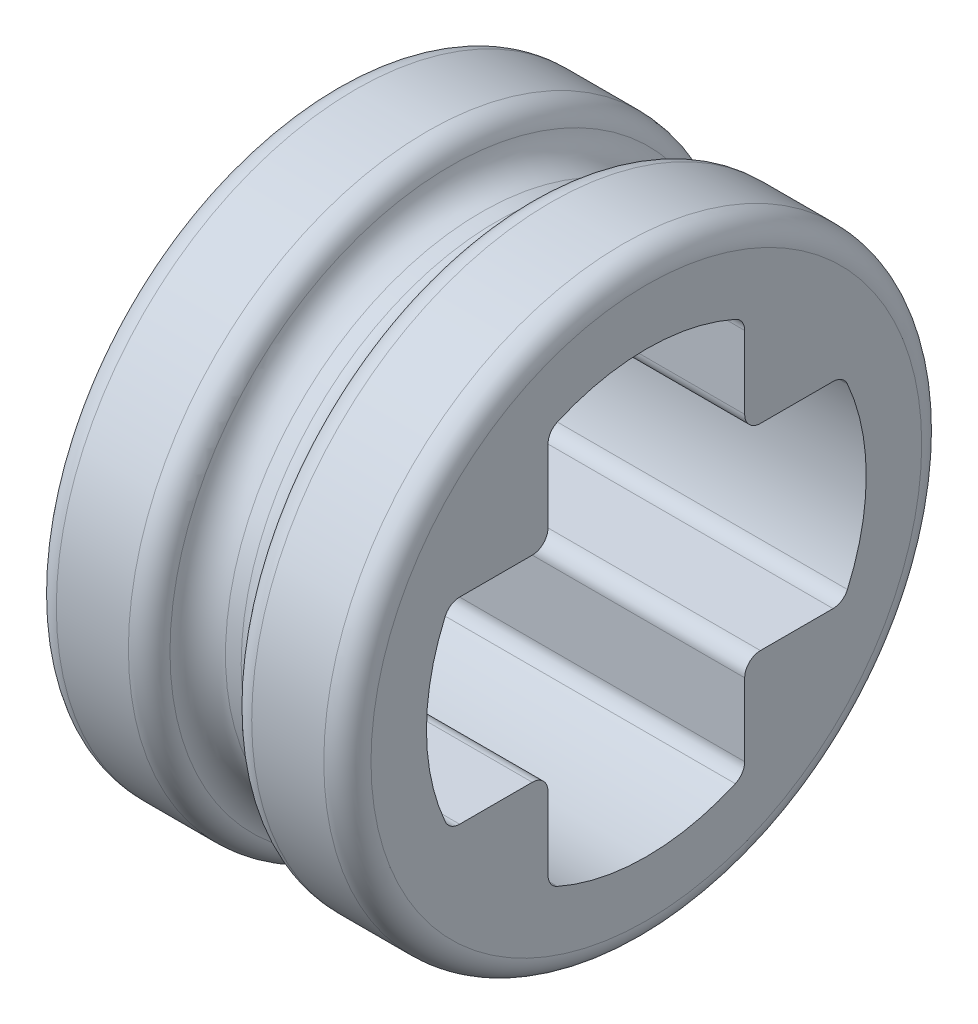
ISO-10303-21;
HEADER;
FILE_DESCRIPTION(('STEP AP214'),'2;1');
FILE_NAME('part.step','',(''),(''),'','','');
FILE_SCHEMA(('AUTOMOTIVE_DESIGN { 1 0 10303 214 1 1 1 1 }'));
ENDSEC;
DATA;
#1=APPLICATION_CONTEXT('core data for automotive mechanical design processes');
#2=APPLICATION_PROTOCOL_DEFINITION('international standard','automotive_design',2000,#1);
#3=PRODUCT_CONTEXT('',#1,'mechanical');
#4=PRODUCT('Part','Part','',(#3));
#5=PRODUCT_RELATED_PRODUCT_CATEGORY('part','',(#4));
#6=PRODUCT_DEFINITION_FORMATION('','',#4);
#7=PRODUCT_DEFINITION_CONTEXT('part definition',#1,'design');
#8=PRODUCT_DEFINITION('design','',#6,#7);
#9=PRODUCT_DEFINITION_SHAPE('','',#8);
#10=(LENGTH_UNIT() NAMED_UNIT(*) SI_UNIT(.MILLI.,.METRE.));
#11=(NAMED_UNIT(*) PLANE_ANGLE_UNIT() SI_UNIT($,.RADIAN.));
#12=(NAMED_UNIT(*) SI_UNIT($,.STERADIAN.) SOLID_ANGLE_UNIT());
#13=UNCERTAINTY_MEASURE_WITH_UNIT(LENGTH_MEASURE(1.E-05),#10,'distance_accuracy_value','');
#14=(GEOMETRIC_REPRESENTATION_CONTEXT(3) GLOBAL_UNCERTAINTY_ASSIGNED_CONTEXT((#13)) GLOBAL_UNIT_ASSIGNED_CONTEXT((#10,
#11,#12)) REPRESENTATION_CONTEXT('',''));
#15=CARTESIAN_POINT('',(0.,0.,0.));
#16=DIRECTION('',(0.,0.,1.));
#17=DIRECTION('',(1.,0.,0.));
#18=AXIS2_PLACEMENT_3D('',#15,#16,#17);
#19=CARTESIAN_POINT('',(2.,0.,0.));
#20=DIRECTION('',(-1.,0.,0.));
#21=DIRECTION('',(0.,0.,1.));
#22=AXIS2_PLACEMENT_3D('',#19,#20,#21);
#23=CYLINDRICAL_SURFACE('',#22,2.79508497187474);
#24=CARTESIAN_POINT('',(-1.95,0.,0.));
#25=DIRECTION('',(-1.,0.,0.));
#26=DIRECTION('',(0.,0.,1.));
#27=AXIS2_PLACEMENT_3D('',#24,#25,#26);
#28=CIRCLE('',#27,2.79508497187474);
#29=CARTESIAN_POINT('',(-1.95,2.55607413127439,-1.13092220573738));
#30=VERTEX_POINT('',#29);
#31=CARTESIAN_POINT('',(-1.95,2.55607413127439,1.13092220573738));
#32=VERTEX_POINT('',#31);
#33=EDGE_CURVE('E549',#30,#32,#28,.F.);
#34=ORIENTED_EDGE('',*,*,#33,.F.);
#35=DIRECTION('',(-1.,0.,0.));
#36=VECTOR('',#35,1.);
#37=CARTESIAN_POINT('',(2.,2.55607413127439,-1.13092220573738));
#38=LINE('',#37,#36);
#39=CARTESIAN_POINT('',(2.,2.55607413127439,-1.13092220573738));
#40=VERTEX_POINT('',#39);
#41=EDGE_CURVE('E411',#30,#40,#38,.F.);
#42=ORIENTED_EDGE('',*,*,#41,.T.);
#43=CARTESIAN_POINT('',(2.,0.,0.));
#44=DIRECTION('',(-1.,0.,0.));
#45=DIRECTION('',(0.,0.,1.));
#46=AXIS2_PLACEMENT_3D('',#43,#44,#45);
#47=CIRCLE('',#46,2.79508497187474);
#48=CARTESIAN_POINT('',(2.,2.55607413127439,1.13092220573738));
#49=VERTEX_POINT('',#48);
#50=EDGE_CURVE('E453',#49,#40,#47,.T.);
#51=ORIENTED_EDGE('',*,*,#50,.F.);
#52=DIRECTION('',(-1.,0.,0.));
#53=VECTOR('',#52,1.);
#54=CARTESIAN_POINT('',(2.,2.55607413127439,1.13092220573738));
#55=LINE('',#54,#53);
#56=EDGE_CURVE('E414',#49,#32,#55,.T.);
#57=ORIENTED_EDGE('',*,*,#56,.T.);
#58=EDGE_LOOP('',(#34,#42,#51,#57));
#59=FACE_BOUND('',#58,.T.);
#60=ADVANCED_FACE('F57',(#59),#23,.F.);
#61=CARTESIAN_POINT('',(2.,2.5,1.25000000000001));
#62=DIRECTION('',(0.,0.,1.));
#63=DIRECTION('',(0.,-1.,0.));
#64=AXIS2_PLACEMENT_3D('',#61,#62,#63);
#65=PLANE('',#64);
#66=DIRECTION('',(0.,-1.,0.));
#67=VECTOR('',#66,1.);
#68=CARTESIAN_POINT('',(-1.95,2.5,1.25000000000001));
#69=LINE('',#68,#67);
#70=CARTESIAN_POINT('',(-1.95,2.37317635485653,1.25000000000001));
#71=VERTEX_POINT('',#70);
#72=CARTESIAN_POINT('',(-1.95,1.45,1.25000000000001));
#73=VERTEX_POINT('',#72);
#74=EDGE_CURVE('E537',#71,#73,#69,.T.);
#75=ORIENTED_EDGE('',*,*,#74,.F.);
#76=DIRECTION('',(1.,0.,0.));
#77=VECTOR('',#76,1.);
#78=CARTESIAN_POINT('',(2.,2.37317635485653,1.25000000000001));
#79=LINE('',#78,#77);
#80=CARTESIAN_POINT('',(2.,2.37317635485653,1.25000000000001));
#81=VERTEX_POINT('',#80);
#82=EDGE_CURVE('E80',#71,#81,#79,.T.);
#83=ORIENTED_EDGE('',*,*,#82,.T.);
#84=DIRECTION('',(0.,1.,0.));
#85=VECTOR('',#84,1.);
#86=CARTESIAN_POINT('',(2.,2.5,1.25000000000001));
#87=LINE('',#86,#85);
#88=CARTESIAN_POINT('',(2.,1.45,1.25000000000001));
#89=VERTEX_POINT('',#88);
#90=EDGE_CURVE('E478',#89,#81,#87,.T.);
#91=ORIENTED_EDGE('',*,*,#90,.F.);
#92=DIRECTION('',(-1.,0.,0.));
#93=VECTOR('',#92,1.);
#94=CARTESIAN_POINT('',(2.,1.45,1.25000000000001));
#95=LINE('',#94,#93);
#96=EDGE_CURVE('E407',#89,#73,#95,.T.);
#97=ORIENTED_EDGE('',*,*,#96,.T.);
#98=EDGE_LOOP('',(#75,#83,#91,#97));
#99=FACE_BOUND('',#98,.T.);
#100=ADVANCED_FACE('F329',(#99),#65,.F.);
#101=CARTESIAN_POINT('',(2.,1.25,1.25000000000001));
#102=DIRECTION('',(0.,1.,0.));
#103=DIRECTION('',(0.,0.,1.));
#104=AXIS2_PLACEMENT_3D('',#101,#102,#103);
#105=PLANE('',#104);
#106=DIRECTION('',(0.,0.,1.));
#107=VECTOR('',#106,1.);
#108=CARTESIAN_POINT('',(-1.95,1.25,1.25000000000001));
#109=LINE('',#108,#107);
#110=CARTESIAN_POINT('',(-1.95,1.25,1.45000000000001));
#111=VERTEX_POINT('',#110);
#112=CARTESIAN_POINT('',(-1.95,1.25,2.37317635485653));
#113=VERTEX_POINT('',#112);
#114=EDGE_CURVE('E524',#111,#113,#109,.T.);
#115=ORIENTED_EDGE('',*,*,#114,.F.);
#116=DIRECTION('',(-1.,0.,0.));
#117=VECTOR('',#116,1.);
#118=CARTESIAN_POINT('',(2.,1.25,1.45000000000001));
#119=LINE('',#118,#117);
#120=CARTESIAN_POINT('',(2.,1.25,1.45000000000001));
#121=VERTEX_POINT('',#120);
#122=EDGE_CURVE('E398',#111,#121,#119,.F.);
#123=ORIENTED_EDGE('',*,*,#122,.T.);
#124=DIRECTION('',(0.,0.,-1.));
#125=VECTOR('',#124,1.);
#126=CARTESIAN_POINT('',(2.,1.25,1.25000000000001));
#127=LINE('',#126,#125);
#128=CARTESIAN_POINT('',(2.,1.25,2.37317635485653));
#129=VERTEX_POINT('',#128);
#130=EDGE_CURVE('E481',#129,#121,#127,.T.);
#131=ORIENTED_EDGE('',*,*,#130,.F.);
#132=DIRECTION('',(1.,0.,0.));
#133=VECTOR('',#132,1.);
#134=CARTESIAN_POINT('',(-2.,1.25,2.37317635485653));
#135=LINE('',#134,#133);
#136=EDGE_CURVE('E401',#129,#113,#135,.F.);
#137=ORIENTED_EDGE('',*,*,#136,.T.);
#138=EDGE_LOOP('',(#115,#123,#131,#137));
#139=FACE_BOUND('',#138,.T.);
#140=ADVANCED_FACE('F335',(#139),#105,.F.);
#141=CARTESIAN_POINT('',(2.,0.,0.));
#142=DIRECTION('',(-1.,0.,0.));
#143=DIRECTION('',(0.,0.,1.));
#144=AXIS2_PLACEMENT_3D('',#141,#142,#143);
#145=CYLINDRICAL_SURFACE('',#144,2.79508497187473);
#146=CARTESIAN_POINT('',(-1.95,0.,0.));
#147=DIRECTION('',(-1.,0.,0.));
#148=DIRECTION('',(0.,0.,1.));
#149=AXIS2_PLACEMENT_3D('',#146,#147,#148);
#150=CIRCLE('',#149,2.79508497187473);
#151=CARTESIAN_POINT('',(-1.95,1.13092220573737,2.55607413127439));
#152=VERTEX_POINT('',#151);
#153=CARTESIAN_POINT('',(-1.95,-1.13092220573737,2.55607413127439));
#154=VERTEX_POINT('',#153);
#155=EDGE_CURVE('E512',#152,#154,#150,.F.);
#156=ORIENTED_EDGE('',*,*,#155,.F.);
#157=DIRECTION('',(-1.,0.,0.));
#158=VECTOR('',#157,1.);
#159=CARTESIAN_POINT('',(2.,1.13092220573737,2.55607413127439));
#160=LINE('',#159,#158);
#161=CARTESIAN_POINT('',(2.,1.13092220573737,2.55607413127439));
#162=VERTEX_POINT('',#161);
#163=EDGE_CURVE('E391',#152,#162,#160,.F.);
#164=ORIENTED_EDGE('',*,*,#163,.T.);
#165=CARTESIAN_POINT('',(2.,0.,0.));
#166=DIRECTION('',(-1.,0.,0.));
#167=DIRECTION('',(0.,0.,1.));
#168=AXIS2_PLACEMENT_3D('',#165,#166,#167);
#169=CIRCLE('',#168,2.79508497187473);
#170=CARTESIAN_POINT('',(2.,-1.13092220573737,2.55607413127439));
#171=VERTEX_POINT('',#170);
#172=EDGE_CURVE('E485',#171,#162,#169,.T.);
#173=ORIENTED_EDGE('',*,*,#172,.F.);
#174=DIRECTION('',(-1.,0.,0.));
#175=VECTOR('',#174,1.);
#176=CARTESIAN_POINT('',(2.,-1.13092220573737,2.55607413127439));
#177=LINE('',#176,#175);
#178=EDGE_CURVE('E394',#171,#154,#177,.T.);
#179=ORIENTED_EDGE('',*,*,#178,.T.);
#180=EDGE_LOOP('',(#156,#164,#173,#179));
#181=FACE_BOUND('',#180,.T.);
#182=ADVANCED_FACE('F596',(#181),#145,.F.);
#183=CARTESIAN_POINT('',(2.,-1.25,1.25000000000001));
#184=DIRECTION('',(0.,-1.,0.));
#185=DIRECTION('',(0.,0.,-1.));
#186=AXIS2_PLACEMENT_3D('',#183,#184,#185);
#187=PLANE('',#186);
#188=DIRECTION('',(0.,0.,-1.));
#189=VECTOR('',#188,1.);
#190=CARTESIAN_POINT('',(-1.95,-1.25,1.25000000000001));
#191=LINE('',#190,#189);
#192=CARTESIAN_POINT('',(-1.95,-1.25,2.37317635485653));
#193=VERTEX_POINT('',#192);
#194=CARTESIAN_POINT('',(-1.95,-1.25,1.45000000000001));
#195=VERTEX_POINT('',#194);
#196=EDGE_CURVE('E515',#193,#195,#191,.T.);
#197=ORIENTED_EDGE('',*,*,#196,.F.);
#198=DIRECTION('',(1.,0.,0.));
#199=VECTOR('',#198,1.);
#200=CARTESIAN_POINT('',(2.,-1.25,2.37317635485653));
#201=LINE('',#200,#199);
#202=CARTESIAN_POINT('',(2.,-1.25,2.37317635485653));
#203=VERTEX_POINT('',#202);
#204=EDGE_CURVE('E467',#193,#203,#201,.T.);
#205=ORIENTED_EDGE('',*,*,#204,.T.);
#206=DIRECTION('',(0.,0.,1.));
#207=VECTOR('',#206,1.);
#208=CARTESIAN_POINT('',(2.,-1.25,1.25000000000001));
#209=LINE('',#208,#207);
#210=CARTESIAN_POINT('',(2.,-1.25,1.45000000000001));
#211=VERTEX_POINT('',#210);
#212=EDGE_CURVE('E365',#211,#203,#209,.T.);
#213=ORIENTED_EDGE('',*,*,#212,.F.);
#214=DIRECTION('',(-1.,0.,0.));
#215=VECTOR('',#214,1.);
#216=CARTESIAN_POINT('',(2.,-1.25,1.45000000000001));
#217=LINE('',#216,#215);
#218=EDGE_CURVE('E375',#211,#195,#217,.T.);
#219=ORIENTED_EDGE('',*,*,#218,.T.);
#220=EDGE_LOOP('',(#197,#205,#213,#219));
#221=FACE_BOUND('',#220,.T.);
#222=ADVANCED_FACE('F600',(#221),#187,.F.);
#223=CARTESIAN_POINT('',(2.,-1.25,1.25000000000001));
#224=DIRECTION('',(0.,0.,1.));
#225=DIRECTION('',(0.,-1.,0.));
#226=AXIS2_PLACEMENT_3D('',#223,#224,#225);
#227=PLANE('',#226);
#228=DIRECTION('',(0.,-1.,0.));
#229=VECTOR('',#228,1.);
#230=CARTESIAN_POINT('',(-1.95,-1.25,1.25000000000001));
#231=LINE('',#230,#229);
#232=CARTESIAN_POINT('',(-1.95,-1.45,1.25000000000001));
#233=VERTEX_POINT('',#232);
#234=CARTESIAN_POINT('',(-1.95,-2.37317635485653,1.25000000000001));
#235=VERTEX_POINT('',#234);
#236=EDGE_CURVE('E527',#233,#235,#231,.T.);
#237=ORIENTED_EDGE('',*,*,#236,.F.);
#238=DIRECTION('',(-1.,0.,0.));
#239=VECTOR('',#238,1.);
#240=CARTESIAN_POINT('',(2.,-1.45,1.25000000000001));
#241=LINE('',#240,#239);
#242=CARTESIAN_POINT('',(2.,-1.45,1.25000000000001));
#243=VERTEX_POINT('',#242);
#244=EDGE_CURVE('E373',#233,#243,#241,.F.);
#245=ORIENTED_EDGE('',*,*,#244,.T.);
#246=DIRECTION('',(0.,1.,0.));
#247=VECTOR('',#246,1.);
#248=CARTESIAN_POINT('',(2.,-1.25,1.25000000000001));
#249=LINE('',#248,#247);
#250=CARTESIAN_POINT('',(2.,-2.37317635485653,1.25000000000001));
#251=VERTEX_POINT('',#250);
#252=EDGE_CURVE('E354',#251,#243,#249,.T.);
#253=ORIENTED_EDGE('',*,*,#252,.F.);
#254=DIRECTION('',(1.,0.,0.));
#255=VECTOR('',#254,1.);
#256=CARTESIAN_POINT('',(-2.,-2.37317635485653,1.25000000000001));
#257=LINE('',#256,#255);
#258=EDGE_CURVE('E460',#251,#235,#257,.F.);
#259=ORIENTED_EDGE('',*,*,#258,.T.);
#260=EDGE_LOOP('',(#237,#245,#253,#259));
#261=FACE_BOUND('',#260,.T.);
#262=ADVANCED_FACE('F604',(#261),#227,.F.);
#263=CARTESIAN_POINT('',(2.,0.,0.));
#264=DIRECTION('',(-1.,0.,0.));
#265=DIRECTION('',(0.,0.,1.));
#266=AXIS2_PLACEMENT_3D('',#263,#264,#265);
#267=CYLINDRICAL_SURFACE('',#266,2.79508497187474);
#268=CARTESIAN_POINT('',(-1.95,0.,0.));
#269=DIRECTION('',(-1.,0.,0.));
#270=DIRECTION('',(0.,0.,1.));
#271=AXIS2_PLACEMENT_3D('',#268,#269,#270);
#272=CIRCLE('',#271,2.79508497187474);
#273=CARTESIAN_POINT('',(-1.95,-2.55607413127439,1.13092220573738));
#274=VERTEX_POINT('',#273);
#275=CARTESIAN_POINT('',(-1.95,-2.55607413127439,-1.13092220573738));
#276=VERTEX_POINT('',#275);
#277=EDGE_CURVE('E540',#274,#276,#272,.F.);
#278=ORIENTED_EDGE('',*,*,#277,.F.);
#279=DIRECTION('',(-1.,0.,0.));
#280=VECTOR('',#279,1.);
#281=CARTESIAN_POINT('',(2.,-2.55607413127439,1.13092220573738));
#282=LINE('',#281,#280);
#283=CARTESIAN_POINT('',(2.,-2.55607413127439,1.13092220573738));
#284=VERTEX_POINT('',#283);
#285=EDGE_CURVE('E383',#274,#284,#282,.F.);
#286=ORIENTED_EDGE('',*,*,#285,.T.);
#287=CARTESIAN_POINT('',(2.,0.,0.));
#288=DIRECTION('',(-1.,0.,0.));
#289=DIRECTION('',(0.,0.,1.));
#290=AXIS2_PLACEMENT_3D('',#287,#288,#289);
#291=CIRCLE('',#290,2.79508497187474);
#292=CARTESIAN_POINT('',(2.,-2.55607413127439,-1.13092220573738));
#293=VERTEX_POINT('',#292);
#294=EDGE_CURVE('E366',#293,#284,#291,.T.);
#295=ORIENTED_EDGE('',*,*,#294,.F.);
#296=DIRECTION('',(-1.,0.,0.));
#297=VECTOR('',#296,1.);
#298=CARTESIAN_POINT('',(2.,-2.55607413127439,-1.13092220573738));
#299=LINE('',#298,#297);
#300=EDGE_CURVE('E377',#293,#276,#299,.T.);
#301=ORIENTED_EDGE('',*,*,#300,.T.);
#302=EDGE_LOOP('',(#278,#286,#295,#301));
#303=FACE_BOUND('',#302,.T.);
#304=ADVANCED_FACE('F608',(#303),#267,.F.);
#305=CARTESIAN_POINT('',(2.,-1.25,-1.25000000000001));
#306=DIRECTION('',(0.,0.,-1.));
#307=DIRECTION('',(-1.,0.,0.));
#308=AXIS2_PLACEMENT_3D('',#305,#306,#307);
#309=PLANE('',#308);
#310=DIRECTION('',(0.,1.,0.));
#311=VECTOR('',#310,1.);
#312=CARTESIAN_POINT('',(-1.95,-1.25,-1.25000000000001));
#313=LINE('',#312,#311);
#314=CARTESIAN_POINT('',(-1.95,-2.37317635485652,-1.25000000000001));
#315=VERTEX_POINT('',#314);
#316=CARTESIAN_POINT('',(-1.95,-1.45,-1.25000000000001));
#317=VERTEX_POINT('',#316);
#318=EDGE_CURVE('E552',#315,#317,#313,.T.);
#319=ORIENTED_EDGE('',*,*,#318,.F.);
#320=DIRECTION('',(1.,0.,0.));
#321=VECTOR('',#320,1.);
#322=CARTESIAN_POINT('',(2.,-2.37317635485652,-1.25000000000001));
#323=LINE('',#322,#321);
#324=CARTESIAN_POINT('',(2.,-2.37317635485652,-1.25000000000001));
#325=VERTEX_POINT('',#324);
#326=EDGE_CURVE('E422',#315,#325,#323,.T.);
#327=ORIENTED_EDGE('',*,*,#326,.T.);
#328=DIRECTION('',(0.,-1.,0.));
#329=VECTOR('',#328,1.);
#330=CARTESIAN_POINT('',(2.,-1.25,-1.25000000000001));
#331=LINE('',#330,#329);
#332=CARTESIAN_POINT('',(2.,-1.45,-1.25000000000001));
#333=VERTEX_POINT('',#332);
#334=EDGE_CURVE('E493',#333,#325,#331,.T.);
#335=ORIENTED_EDGE('',*,*,#334,.F.);
#336=DIRECTION('',(-1.,0.,0.));
#337=VECTOR('',#336,1.);
#338=CARTESIAN_POINT('',(2.,-1.45,-1.25000000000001));
#339=LINE('',#338,#337);
#340=EDGE_CURVE('E418',#333,#317,#339,.T.);
#341=ORIENTED_EDGE('',*,*,#340,.T.);
#342=EDGE_LOOP('',(#319,#327,#335,#341));
#343=FACE_BOUND('',#342,.T.);
#344=ADVANCED_FACE('F611',(#343),#309,.F.);
#345=CARTESIAN_POINT('',(2.,-1.25,-2.5));
#346=DIRECTION('',(0.,-1.,0.));
#347=DIRECTION('',(0.,0.,-1.));
#348=AXIS2_PLACEMENT_3D('',#345,#346,#347);
#349=PLANE('',#348);
#350=DIRECTION('',(0.,0.,-1.));
#351=VECTOR('',#350,1.);
#352=CARTESIAN_POINT('',(-1.95,-1.25,-2.5));
#353=LINE('',#352,#351);
#354=CARTESIAN_POINT('',(-1.95,-1.25,-1.45000000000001));
#355=VERTEX_POINT('',#354);
#356=CARTESIAN_POINT('',(-1.95,-1.25,-2.37317635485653));
#357=VERTEX_POINT('',#356);
#358=EDGE_CURVE('E562',#355,#357,#353,.T.);
#359=ORIENTED_EDGE('',*,*,#358,.F.);
#360=DIRECTION('',(-1.,0.,0.));
#361=VECTOR('',#360,1.);
#362=CARTESIAN_POINT('',(2.,-1.25,-1.45000000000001));
#363=LINE('',#362,#361);
#364=CARTESIAN_POINT('',(2.,-1.25,-1.45000000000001));
#365=VERTEX_POINT('',#364);
#366=EDGE_CURVE('E425',#355,#365,#363,.F.);
#367=ORIENTED_EDGE('',*,*,#366,.T.);
#368=DIRECTION('',(0.,0.,1.));
#369=VECTOR('',#368,1.);
#370=CARTESIAN_POINT('',(2.,-1.25,-2.5));
#371=LINE('',#370,#369);
#372=CARTESIAN_POINT('',(2.,-1.25,-2.37317635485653));
#373=VERTEX_POINT('',#372);
#374=EDGE_CURVE('E497',#373,#365,#371,.T.);
#375=ORIENTED_EDGE('',*,*,#374,.F.);
#376=DIRECTION('',(1.,0.,0.));
#377=VECTOR('',#376,1.);
#378=CARTESIAN_POINT('',(-2.,-1.25,-2.37317635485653));
#379=LINE('',#378,#377);
#380=EDGE_CURVE('E428',#373,#357,#379,.F.);
#381=ORIENTED_EDGE('',*,*,#380,.T.);
#382=EDGE_LOOP('',(#359,#367,#375,#381));
#383=FACE_BOUND('',#382,.T.);
#384=ADVANCED_FACE('F615',(#383),#349,.F.);
#385=CARTESIAN_POINT('',(2.,0.,0.));
#386=DIRECTION('',(-1.,0.,0.));
#387=DIRECTION('',(0.,0.,1.));
#388=AXIS2_PLACEMENT_3D('',#385,#386,#387);
#389=CYLINDRICAL_SURFACE('',#388,2.79508497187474);
#390=CARTESIAN_POINT('',(-1.95,0.,0.));
#391=DIRECTION('',(-1.,0.,0.));
#392=DIRECTION('',(0.,0.,1.));
#393=AXIS2_PLACEMENT_3D('',#390,#391,#392);
#394=CIRCLE('',#393,2.79508497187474);
#395=CARTESIAN_POINT('',(-1.95,-1.13092220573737,-2.55607413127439));
#396=VERTEX_POINT('',#395);
#397=CARTESIAN_POINT('',(-1.95,1.13092220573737,-2.55607413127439));
#398=VERTEX_POINT('',#397);
#399=EDGE_CURVE('E72',#396,#398,#394,.F.);
#400=ORIENTED_EDGE('',*,*,#399,.F.);
#401=DIRECTION('',(-1.,0.,0.));
#402=VECTOR('',#401,1.);
#403=CARTESIAN_POINT('',(2.,-1.13092220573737,-2.55607413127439));
#404=LINE('',#403,#402);
#405=CARTESIAN_POINT('',(2.,-1.13092220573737,-2.55607413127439));
#406=VERTEX_POINT('',#405);
#407=EDGE_CURVE('E435',#396,#406,#404,.F.);
#408=ORIENTED_EDGE('',*,*,#407,.T.);
#409=CARTESIAN_POINT('',(2.,0.,0.));
#410=DIRECTION('',(-1.,0.,0.));
#411=DIRECTION('',(0.,0.,1.));
#412=AXIS2_PLACEMENT_3D('',#409,#410,#411);
#413=CIRCLE('',#412,2.79508497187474);
#414=CARTESIAN_POINT('',(2.,1.13092220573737,-2.55607413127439));
#415=VERTEX_POINT('',#414);
#416=EDGE_CURVE('E501',#415,#406,#413,.T.);
#417=ORIENTED_EDGE('',*,*,#416,.F.);
#418=DIRECTION('',(-1.,0.,0.));
#419=VECTOR('',#418,1.);
#420=CARTESIAN_POINT('',(2.,1.13092220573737,-2.55607413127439));
#421=LINE('',#420,#419);
#422=EDGE_CURVE('E432',#415,#398,#421,.T.);
#423=ORIENTED_EDGE('',*,*,#422,.T.);
#424=EDGE_LOOP('',(#400,#408,#417,#423));
#425=FACE_BOUND('',#424,.T.);
#426=ADVANCED_FACE('F619',(#425),#389,.F.);
#427=CARTESIAN_POINT('',(2.,1.25,-2.5));
#428=DIRECTION('',(0.,1.,0.));
#429=DIRECTION('',(0.,0.,1.));
#430=AXIS2_PLACEMENT_3D('',#427,#428,#429);
#431=PLANE('',#430);
#432=DIRECTION('',(0.,0.,1.));
#433=VECTOR('',#432,1.);
#434=CARTESIAN_POINT('',(-1.95,1.25,-2.5));
#435=LINE('',#434,#433);
#436=CARTESIAN_POINT('',(-1.95,1.25,-2.37317635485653));
#437=VERTEX_POINT('',#436);
#438=CARTESIAN_POINT('',(-1.95,1.25,-1.45000000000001));
#439=VERTEX_POINT('',#438);
#440=EDGE_CURVE('E219',#437,#439,#435,.T.);
#441=ORIENTED_EDGE('',*,*,#440,.F.);
#442=DIRECTION('',(1.,0.,0.));
#443=VECTOR('',#442,1.);
#444=CARTESIAN_POINT('',(2.,1.25,-2.37317635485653));
#445=LINE('',#444,#443);
#446=CARTESIAN_POINT('',(2.,1.25,-2.37317635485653));
#447=VERTEX_POINT('',#446);
#448=EDGE_CURVE('E229',#437,#447,#445,.T.);
#449=ORIENTED_EDGE('',*,*,#448,.T.);
#450=DIRECTION('',(0.,0.,-1.));
#451=VECTOR('',#450,1.);
#452=CARTESIAN_POINT('',(2.,1.25,-2.5));
#453=LINE('',#452,#451);
#454=CARTESIAN_POINT('',(2.,1.25,-1.45000000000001));
#455=VERTEX_POINT('',#454);
#456=EDGE_CURVE('E452',#455,#447,#453,.T.);
#457=ORIENTED_EDGE('',*,*,#456,.F.);
#458=DIRECTION('',(-1.,0.,0.));
#459=VECTOR('',#458,1.);
#460=CARTESIAN_POINT('',(2.,1.25,-1.45000000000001));
#461=LINE('',#460,#459);
#462=EDGE_CURVE('E232',#455,#439,#461,.T.);
#463=ORIENTED_EDGE('',*,*,#462,.T.);
#464=EDGE_LOOP('',(#441,#449,#457,#463));
#465=FACE_BOUND('',#464,.T.);
#466=ADVANCED_FACE('F227',(#465),#431,.F.);
#467=CARTESIAN_POINT('',(2.,2.5,-1.25000000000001));
#468=DIRECTION('',(0.,0.,-1.));
#469=DIRECTION('',(-1.,0.,0.));
#470=AXIS2_PLACEMENT_3D('',#467,#468,#469);
#471=PLANE('',#470);
#472=DIRECTION('',(0.,1.,0.));
#473=VECTOR('',#472,1.);
#474=CARTESIAN_POINT('',(-1.95,2.5,-1.25000000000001));
#475=LINE('',#474,#473);
#476=CARTESIAN_POINT('',(-1.95,1.45,-1.25000000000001));
#477=VERTEX_POINT('',#476);
#478=CARTESIAN_POINT('',(-1.95,2.37317635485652,-1.25000000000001));
#479=VERTEX_POINT('',#478);
#480=EDGE_CURVE('E445',#477,#479,#475,.T.);
#481=ORIENTED_EDGE('',*,*,#480,.F.);
#482=DIRECTION('',(-1.,0.,0.));
#483=VECTOR('',#482,1.);
#484=CARTESIAN_POINT('',(2.,1.45,-1.25000000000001));
#485=LINE('',#484,#483);
#486=CARTESIAN_POINT('',(2.,1.45,-1.25000000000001));
#487=VERTEX_POINT('',#486);
#488=EDGE_CURVE('E247',#477,#487,#485,.F.);
#489=ORIENTED_EDGE('',*,*,#488,.T.);
#490=DIRECTION('',(0.,-1.,0.));
#491=VECTOR('',#490,1.);
#492=CARTESIAN_POINT('',(2.,2.5,-1.25000000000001));
#493=LINE('',#492,#491);
#494=CARTESIAN_POINT('',(2.,2.37317635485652,-1.25000000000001));
#495=VERTEX_POINT('',#494);
#496=EDGE_CURVE('E443',#495,#487,#493,.T.);
#497=ORIENTED_EDGE('',*,*,#496,.F.);
#498=DIRECTION('',(1.,0.,0.));
#499=VECTOR('',#498,1.);
#500=CARTESIAN_POINT('',(-2.,2.37317635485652,-1.25000000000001));
#501=LINE('',#500,#499);
#502=EDGE_CURVE('E240',#495,#479,#501,.F.);
#503=ORIENTED_EDGE('',*,*,#502,.T.);
#504=EDGE_LOOP('',(#481,#489,#497,#503));
#505=FACE_BOUND('',#504,.T.);
#506=ADVANCED_FACE('F340',(#505),#471,.F.);
#507=CARTESIAN_POINT('',(2.,-1.45,1.45000000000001));
#508=DIRECTION('',(-1.,0.,0.));
#509=DIRECTION('',(0.,0.,1.));
#510=AXIS2_PLACEMENT_3D('',#507,#508,#509);
#511=CYLINDRICAL_SURFACE('',#510,0.2);
#512=ORIENTED_EDGE('',*,*,#244,.F.);
#513=CARTESIAN_POINT('',(-1.95,-1.45,1.45000000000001));
#514=DIRECTION('',(-1.,0.,0.));
#515=DIRECTION('',(0.,0.,1.));
#516=AXIS2_PLACEMENT_3D('',#513,#514,#515);
#517=CIRCLE('',#516,0.2);
#518=EDGE_CURVE('E518',#233,#195,#517,.F.);
#519=ORIENTED_EDGE('',*,*,#518,.T.);
#520=ORIENTED_EDGE('',*,*,#218,.F.);
#521=CARTESIAN_POINT('',(2.,-1.45,1.45000000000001));
#522=DIRECTION('',(1.,0.,0.));
#523=DIRECTION('',(0.,0.,-1.));
#524=AXIS2_PLACEMENT_3D('',#521,#522,#523);
#525=CIRCLE('',#524,0.2);
#526=EDGE_CURVE('E357',#243,#211,#525,.T.);
#527=ORIENTED_EDGE('',*,*,#526,.F.);
#528=EDGE_LOOP('',(#512,#519,#520,#527));
#529=FACE_BOUND('',#528,.T.);
#530=ADVANCED_FACE('F371',(#529),#511,.T.);
#531=CARTESIAN_POINT('',(2.,-2.37317635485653,1.05000000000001));
#532=DIRECTION('',(-1.,0.,0.));
#533=DIRECTION('',(0.,0.,1.));
#534=AXIS2_PLACEMENT_3D('',#531,#532,#533);
#535=CYLINDRICAL_SURFACE('',#534,0.2);
#536=CARTESIAN_POINT('',(-1.95,-2.37317635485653,1.05000000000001));
#537=DIRECTION('',(-1.,0.,0.));
#538=DIRECTION('',(0.,0.,1.));
#539=AXIS2_PLACEMENT_3D('',#536,#537,#538);
#540=CIRCLE('',#539,0.2);
#541=EDGE_CURVE('E530',#235,#274,#540,.F.);
#542=ORIENTED_EDGE('',*,*,#541,.F.);
#543=ORIENTED_EDGE('',*,*,#258,.F.);
#544=CARTESIAN_POINT('',(2.,-2.37317635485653,1.05000000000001));
#545=DIRECTION('',(1.,0.,0.));
#546=DIRECTION('',(0.,0.,-1.));
#547=AXIS2_PLACEMENT_3D('',#544,#545,#546);
#548=CIRCLE('',#547,0.2);
#549=EDGE_CURVE('E244',#284,#251,#548,.F.);
#550=ORIENTED_EDGE('',*,*,#549,.F.);
#551=ORIENTED_EDGE('',*,*,#285,.F.);
#552=EDGE_LOOP('',(#542,#543,#550,#551));
#553=FACE_BOUND('',#552,.T.);
#554=ADVANCED_FACE('F630',(#553),#535,.F.);
#555=CARTESIAN_POINT('',(2.,-1.05,2.37317635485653));
#556=DIRECTION('',(-1.,0.,0.));
#557=DIRECTION('',(0.,0.,1.));
#558=AXIS2_PLACEMENT_3D('',#555,#556,#557);
#559=CYLINDRICAL_SURFACE('',#558,0.2);
#560=CARTESIAN_POINT('',(-1.95,-1.05,2.37317635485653));
#561=DIRECTION('',(-1.,0.,0.));
#562=DIRECTION('',(0.,0.,1.));
#563=AXIS2_PLACEMENT_3D('',#560,#561,#562);
#564=CIRCLE('',#563,0.2);
#565=EDGE_CURVE('E509',#154,#193,#564,.F.);
#566=ORIENTED_EDGE('',*,*,#565,.F.);
#567=ORIENTED_EDGE('',*,*,#178,.F.);
#568=CARTESIAN_POINT('',(2.,-1.05,2.37317635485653));
#569=DIRECTION('',(1.,0.,0.));
#570=DIRECTION('',(0.,0.,-1.));
#571=AXIS2_PLACEMENT_3D('',#568,#569,#570);
#572=CIRCLE('',#571,0.2);
#573=EDGE_CURVE('E253',#203,#171,#572,.F.);
#574=ORIENTED_EDGE('',*,*,#573,.F.);
#575=ORIENTED_EDGE('',*,*,#204,.F.);
#576=EDGE_LOOP('',(#566,#567,#574,#575));
#577=FACE_BOUND('',#576,.T.);
#578=ADVANCED_FACE('F635',(#577),#559,.F.);
#579=CARTESIAN_POINT('',(2.,1.05,2.37317635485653));
#580=DIRECTION('',(-1.,0.,0.));
#581=DIRECTION('',(0.,0.,1.));
#582=AXIS2_PLACEMENT_3D('',#579,#580,#581);
#583=CYLINDRICAL_SURFACE('',#582,0.2);
#584=CARTESIAN_POINT('',(-1.95,1.05,2.37317635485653));
#585=DIRECTION('',(-1.,0.,0.));
#586=DIRECTION('',(0.,0.,1.));
#587=AXIS2_PLACEMENT_3D('',#584,#585,#586);
#588=CIRCLE('',#587,0.2);
#589=EDGE_CURVE('E521',#113,#152,#588,.F.);
#590=ORIENTED_EDGE('',*,*,#589,.F.);
#591=ORIENTED_EDGE('',*,*,#136,.F.);
#592=CARTESIAN_POINT('',(2.,1.05,2.37317635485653));
#593=DIRECTION('',(1.,0.,0.));
#594=DIRECTION('',(0.,0.,-1.));
#595=AXIS2_PLACEMENT_3D('',#592,#593,#594);
#596=CIRCLE('',#595,0.2);
#597=EDGE_CURVE('E256',#162,#129,#596,.F.);
#598=ORIENTED_EDGE('',*,*,#597,.F.);
#599=ORIENTED_EDGE('',*,*,#163,.F.);
#600=EDGE_LOOP('',(#590,#591,#598,#599));
#601=FACE_BOUND('',#600,.T.);
#602=ADVANCED_FACE('F642',(#601),#583,.F.);
#603=CARTESIAN_POINT('',(2.,1.45,1.45000000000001));
#604=DIRECTION('',(-1.,0.,0.));
#605=DIRECTION('',(0.,0.,1.));
#606=AXIS2_PLACEMENT_3D('',#603,#604,#605);
#607=CYLINDRICAL_SURFACE('',#606,0.2);
#608=ORIENTED_EDGE('',*,*,#122,.F.);
#609=CARTESIAN_POINT('',(-1.95,1.45,1.45000000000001));
#610=DIRECTION('',(-1.,0.,0.));
#611=DIRECTION('',(0.,0.,1.));
#612=AXIS2_PLACEMENT_3D('',#609,#610,#611);
#613=CIRCLE('',#612,0.2);
#614=EDGE_CURVE('E533',#111,#73,#613,.F.);
#615=ORIENTED_EDGE('',*,*,#614,.T.);
#616=ORIENTED_EDGE('',*,*,#96,.F.);
#617=CARTESIAN_POINT('',(2.,1.45,1.45000000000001));
#618=DIRECTION('',(1.,0.,0.));
#619=DIRECTION('',(0.,0.,-1.));
#620=AXIS2_PLACEMENT_3D('',#617,#618,#619);
#621=CIRCLE('',#620,0.2);
#622=EDGE_CURVE('E378',#121,#89,#621,.T.);
#623=ORIENTED_EDGE('',*,*,#622,.F.);
#624=EDGE_LOOP('',(#608,#615,#616,#623));
#625=FACE_BOUND('',#624,.T.);
#626=ADVANCED_FACE('F646',(#625),#607,.T.);
#627=CARTESIAN_POINT('',(2.,2.37317635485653,1.05000000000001));
#628=DIRECTION('',(-1.,0.,0.));
#629=DIRECTION('',(0.,0.,1.));
#630=AXIS2_PLACEMENT_3D('',#627,#628,#629);
#631=CYLINDRICAL_SURFACE('',#630,0.2);
#632=CARTESIAN_POINT('',(-1.95,2.37317635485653,1.05000000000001));
#633=DIRECTION('',(-1.,0.,0.));
#634=DIRECTION('',(0.,0.,1.));
#635=AXIS2_PLACEMENT_3D('',#632,#633,#634);
#636=CIRCLE('',#635,0.2);
#637=EDGE_CURVE('E543',#32,#71,#636,.F.);
#638=ORIENTED_EDGE('',*,*,#637,.F.);
#639=ORIENTED_EDGE('',*,*,#56,.F.);
#640=CARTESIAN_POINT('',(2.,2.37317635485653,1.05000000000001));
#641=DIRECTION('',(1.,0.,0.));
#642=DIRECTION('',(0.,0.,-1.));
#643=AXIS2_PLACEMENT_3D('',#640,#641,#642);
#644=CIRCLE('',#643,0.2);
#645=EDGE_CURVE('E259',#81,#49,#644,.F.);
#646=ORIENTED_EDGE('',*,*,#645,.F.);
#647=ORIENTED_EDGE('',*,*,#82,.F.);
#648=EDGE_LOOP('',(#638,#639,#646,#647));
#649=FACE_BOUND('',#648,.T.);
#650=ADVANCED_FACE('F650',(#649),#631,.F.);
#651=CARTESIAN_POINT('',(2.,-2.37317635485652,-1.05000000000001));
#652=DIRECTION('',(-1.,0.,0.));
#653=DIRECTION('',(0.,0.,1.));
#654=AXIS2_PLACEMENT_3D('',#651,#652,#653);
#655=CYLINDRICAL_SURFACE('',#654,0.2);
#656=CARTESIAN_POINT('',(-1.95,-2.37317635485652,-1.05000000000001));
#657=DIRECTION('',(-1.,0.,0.));
#658=DIRECTION('',(0.,0.,1.));
#659=AXIS2_PLACEMENT_3D('',#656,#657,#658);
#660=CIRCLE('',#659,0.2);
#661=EDGE_CURVE('E546',#276,#315,#660,.F.);
#662=ORIENTED_EDGE('',*,*,#661,.F.);
#663=ORIENTED_EDGE('',*,*,#300,.F.);
#664=CARTESIAN_POINT('',(2.,-2.37317635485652,-1.05000000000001));
#665=DIRECTION('',(1.,0.,0.));
#666=DIRECTION('',(0.,0.,-1.));
#667=AXIS2_PLACEMENT_3D('',#664,#665,#666);
#668=CIRCLE('',#667,0.2);
#669=EDGE_CURVE('E262',#325,#293,#668,.F.);
#670=ORIENTED_EDGE('',*,*,#669,.F.);
#671=ORIENTED_EDGE('',*,*,#326,.F.);
#672=EDGE_LOOP('',(#662,#663,#670,#671));
#673=FACE_BOUND('',#672,.T.);
#674=ADVANCED_FACE('F654',(#673),#655,.F.);
#675=CARTESIAN_POINT('',(2.,-1.05,-2.37317635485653));
#676=DIRECTION('',(-1.,0.,0.));
#677=DIRECTION('',(0.,0.,1.));
#678=AXIS2_PLACEMENT_3D('',#675,#676,#677);
#679=CYLINDRICAL_SURFACE('',#678,0.2);
#680=CARTESIAN_POINT('',(-1.95,-1.05,-2.37317635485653));
#681=DIRECTION('',(-1.,0.,0.));
#682=DIRECTION('',(0.,0.,1.));
#683=AXIS2_PLACEMENT_3D('',#680,#681,#682);
#684=CIRCLE('',#683,0.2);
#685=EDGE_CURVE('E567',#357,#396,#684,.F.);
#686=ORIENTED_EDGE('',*,*,#685,.F.);
#687=ORIENTED_EDGE('',*,*,#380,.F.);
#688=CARTESIAN_POINT('',(2.,-1.05,-2.37317635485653));
#689=DIRECTION('',(1.,0.,0.));
#690=DIRECTION('',(0.,0.,-1.));
#691=AXIS2_PLACEMENT_3D('',#688,#689,#690);
#692=CIRCLE('',#691,0.2);
#693=EDGE_CURVE('E265',#406,#373,#692,.F.);
#694=ORIENTED_EDGE('',*,*,#693,.F.);
#695=ORIENTED_EDGE('',*,*,#407,.F.);
#696=EDGE_LOOP('',(#686,#687,#694,#695));
#697=FACE_BOUND('',#696,.T.);
#698=ADVANCED_FACE('F658',(#697),#679,.F.);
#699=CARTESIAN_POINT('',(2.,-1.45,-1.45000000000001));
#700=DIRECTION('',(-1.,0.,0.));
#701=DIRECTION('',(0.,0.,1.));
#702=AXIS2_PLACEMENT_3D('',#699,#700,#701);
#703=CYLINDRICAL_SURFACE('',#702,0.2);
#704=ORIENTED_EDGE('',*,*,#366,.F.);
#705=CARTESIAN_POINT('',(-1.95,-1.45,-1.45000000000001));
#706=DIRECTION('',(-1.,0.,0.));
#707=DIRECTION('',(0.,0.,1.));
#708=AXIS2_PLACEMENT_3D('',#705,#706,#707);
#709=CIRCLE('',#708,0.2);
#710=EDGE_CURVE('E555',#355,#317,#709,.F.);
#711=ORIENTED_EDGE('',*,*,#710,.T.);
#712=ORIENTED_EDGE('',*,*,#340,.F.);
#713=CARTESIAN_POINT('',(2.,-1.45,-1.45000000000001));
#714=DIRECTION('',(1.,0.,0.));
#715=DIRECTION('',(0.,0.,-1.));
#716=AXIS2_PLACEMENT_3D('',#713,#714,#715);
#717=CIRCLE('',#716,0.2);
#718=EDGE_CURVE('E385',#365,#333,#717,.T.);
#719=ORIENTED_EDGE('',*,*,#718,.F.);
#720=EDGE_LOOP('',(#704,#711,#712,#719));
#721=FACE_BOUND('',#720,.T.);
#722=ADVANCED_FACE('F662',(#721),#703,.T.);
#723=CARTESIAN_POINT('',(2.,2.37317635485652,-1.05000000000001));
#724=DIRECTION('',(-1.,0.,0.));
#725=DIRECTION('',(0.,0.,1.));
#726=AXIS2_PLACEMENT_3D('',#723,#724,#725);
#727=CYLINDRICAL_SURFACE('',#726,0.2);
#728=CARTESIAN_POINT('',(-1.95,2.37317635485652,-1.05000000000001));
#729=DIRECTION('',(-1.,0.,0.));
#730=DIRECTION('',(0.,0.,1.));
#731=AXIS2_PLACEMENT_3D('',#728,#729,#730);
#732=CIRCLE('',#731,0.2);
#733=EDGE_CURVE('E559',#479,#30,#732,.F.);
#734=ORIENTED_EDGE('',*,*,#733,.F.);
#735=ORIENTED_EDGE('',*,*,#502,.F.);
#736=CARTESIAN_POINT('',(2.,2.37317635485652,-1.05000000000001));
#737=DIRECTION('',(1.,0.,0.));
#738=DIRECTION('',(0.,0.,-1.));
#739=AXIS2_PLACEMENT_3D('',#736,#737,#738);
#740=CIRCLE('',#739,0.2);
#741=EDGE_CURVE('E268',#40,#495,#740,.F.);
#742=ORIENTED_EDGE('',*,*,#741,.F.);
#743=ORIENTED_EDGE('',*,*,#41,.F.);
#744=EDGE_LOOP('',(#734,#735,#742,#743));
#745=FACE_BOUND('',#744,.T.);
#746=ADVANCED_FACE('F666',(#745),#727,.F.);
#747=CARTESIAN_POINT('',(2.,1.45,-1.45000000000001));
#748=DIRECTION('',(-1.,0.,0.));
#749=DIRECTION('',(0.,0.,1.));
#750=AXIS2_PLACEMENT_3D('',#747,#748,#749);
#751=CYLINDRICAL_SURFACE('',#750,0.2);
#752=ORIENTED_EDGE('',*,*,#488,.F.);
#753=CARTESIAN_POINT('',(-1.95,1.45,-1.45000000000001));
#754=DIRECTION('',(-1.,0.,0.));
#755=DIRECTION('',(0.,0.,1.));
#756=AXIS2_PLACEMENT_3D('',#753,#754,#755);
#757=CIRCLE('',#756,0.2);
#758=EDGE_CURVE('E570',#477,#439,#757,.F.);
#759=ORIENTED_EDGE('',*,*,#758,.T.);
#760=ORIENTED_EDGE('',*,*,#462,.F.);
#761=CARTESIAN_POINT('',(2.,1.45,-1.45000000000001));
#762=DIRECTION('',(1.,0.,0.));
#763=DIRECTION('',(0.,0.,-1.));
#764=AXIS2_PLACEMENT_3D('',#761,#762,#763);
#765=CIRCLE('',#764,0.2);
#766=EDGE_CURVE('E448',#487,#455,#765,.T.);
#767=ORIENTED_EDGE('',*,*,#766,.F.);
#768=EDGE_LOOP('',(#752,#759,#760,#767));
#769=FACE_BOUND('',#768,.T.);
#770=ADVANCED_FACE('F455',(#769),#751,.T.);
#771=CARTESIAN_POINT('',(2.,1.05,-2.37317635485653));
#772=DIRECTION('',(-1.,0.,0.));
#773=DIRECTION('',(0.,0.,1.));
#774=AXIS2_PLACEMENT_3D('',#771,#772,#773);
#775=CYLINDRICAL_SURFACE('',#774,0.2);
#776=CARTESIAN_POINT('',(-1.95,1.05,-2.37317635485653));
#777=DIRECTION('',(-1.,0.,0.));
#778=DIRECTION('',(0.,0.,1.));
#779=AXIS2_PLACEMENT_3D('',#776,#777,#778);
#780=CIRCLE('',#779,0.2);
#781=EDGE_CURVE('E13',#398,#437,#780,.F.);
#782=ORIENTED_EDGE('',*,*,#781,.F.);
#783=ORIENTED_EDGE('',*,*,#422,.F.);
#784=CARTESIAN_POINT('',(2.,1.05,-2.37317635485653));
#785=DIRECTION('',(1.,0.,0.));
#786=DIRECTION('',(0.,0.,-1.));
#787=AXIS2_PLACEMENT_3D('',#784,#785,#786);
#788=CIRCLE('',#787,0.2);
#789=EDGE_CURVE('E238',#447,#415,#788,.F.);
#790=ORIENTED_EDGE('',*,*,#789,.F.);
#791=ORIENTED_EDGE('',*,*,#448,.F.);
#792=EDGE_LOOP('',(#782,#783,#790,#791));
#793=FACE_BOUND('',#792,.T.);
#794=ADVANCED_FACE('F237',(#793),#775,.F.);
#795=CARTESIAN_POINT('',(2.,0.,0.));
#796=DIRECTION('',(1.,0.,0.));
#797=DIRECTION('',(0.,0.,-1.));
#798=AXIS2_PLACEMENT_3D('',#795,#796,#797);
#799=CYLINDRICAL_SURFACE('',#798,3.8);
#800=CARTESIAN_POINT('',(1.7,0.,0.));
#801=DIRECTION('',(1.,0.,0.));
#802=DIRECTION('',(0.,0.,-1.));
#803=AXIS2_PLACEMENT_3D('',#800,#801,#802);
#804=CIRCLE('',#803,3.8);
#805=CARTESIAN_POINT('',(1.7,0.,-3.8));
#806=VERTEX_POINT('',#805);
#807=EDGE_CURVE('E281',#806,#806,#804,.F.);
#808=ORIENTED_EDGE('',*,*,#807,.T.);
#809=EDGE_LOOP('',(#808));
#810=FACE_BOUND('',#809,.T.);
#811=CARTESIAN_POINT('',(0.783739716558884,0.,0.));
#812=DIRECTION('',(-1.,0.,0.));
#813=DIRECTION('',(0.,0.,1.));
#814=AXIS2_PLACEMENT_3D('',#811,#812,#813);
#815=CIRCLE('',#814,3.8);
#816=CARTESIAN_POINT('',(0.783739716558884,0.,3.8));
#817=VERTEX_POINT('',#816);
#818=EDGE_CURVE('E277',#817,#817,#815,.F.);
#819=ORIENTED_EDGE('',*,*,#818,.T.);
#820=EDGE_LOOP('',(#819));
#821=FACE_BOUND('',#820,.T.);
#822=ADVANCED_FACE('F325',(#810,#821),#799,.T.);
#823=CARTESIAN_POINT('',(2.,0.,0.));
#824=DIRECTION('',(1.,0.,0.));
#825=DIRECTION('',(0.,0.,-1.));
#826=AXIS2_PLACEMENT_3D('',#823,#824,#825);
#827=CYLINDRICAL_SURFACE('',#826,3.25000000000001);
#828=CARTESIAN_POINT('',(0.1,0.,0.));
#829=DIRECTION('',(-1.,0.,0.));
#830=DIRECTION('',(0.,0.,1.));
#831=AXIS2_PLACEMENT_3D('',#828,#829,#830);
#832=CIRCLE('',#831,3.25000000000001);
#833=CARTESIAN_POINT('',(0.1,0.,3.25000000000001));
#834=VERTEX_POINT('',#833);
#835=EDGE_CURVE('E470',#834,#834,#832,.T.);
#836=ORIENTED_EDGE('',*,*,#835,.T.);
#837=EDGE_LOOP('',(#836));
#838=FACE_BOUND('',#837,.T.);
#839=CARTESIAN_POINT('',(-0.0999999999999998,0.,0.));
#840=DIRECTION('',(1.,0.,0.));
#841=DIRECTION('',(0.,0.,-1.));
#842=AXIS2_PLACEMENT_3D('',#839,#840,#841);
#843=CIRCLE('',#842,3.25000000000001);
#844=CARTESIAN_POINT('',(-0.0999999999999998,0.,-3.25000000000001));
#845=VERTEX_POINT('',#844);
#846=EDGE_CURVE('E474',#845,#845,#843,.T.);
#847=ORIENTED_EDGE('',*,*,#846,.T.);
#848=EDGE_LOOP('',(#847));
#849=FACE_BOUND('',#848,.T.);
#850=ADVANCED_FACE('F313',(#838,#849),#827,.T.);
#851=CARTESIAN_POINT('',(2.,0.,0.));
#852=DIRECTION('',(1.,0.,0.));
#853=DIRECTION('',(0.,0.,-1.));
#854=AXIS2_PLACEMENT_3D('',#851,#852,#853);
#855=CYLINDRICAL_SURFACE('',#854,3.8);
#856=CARTESIAN_POINT('',(-0.783739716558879,0.,0.));
#857=DIRECTION('',(-1.,0.,0.));
#858=DIRECTION('',(0.,0.,1.));
#859=AXIS2_PLACEMENT_3D('',#856,#857,#858);
#860=CIRCLE('',#859,3.8);
#861=CARTESIAN_POINT('',(-0.783739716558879,0.,3.8));
#862=VERTEX_POINT('',#861);
#863=EDGE_CURVE('E297',#862,#862,#860,.T.);
#864=ORIENTED_EDGE('',*,*,#863,.T.);
#865=EDGE_LOOP('',(#864));
#866=FACE_BOUND('',#865,.T.);
#867=CARTESIAN_POINT('',(-1.7,0.,0.));
#868=DIRECTION('',(-1.,0.,0.));
#869=DIRECTION('',(0.,0.,1.));
#870=AXIS2_PLACEMENT_3D('',#867,#868,#869);
#871=CIRCLE('',#870,3.8);
#872=CARTESIAN_POINT('',(-1.7,0.,3.8));
#873=VERTEX_POINT('',#872);
#874=EDGE_CURVE('E293',#873,#873,#871,.F.);
#875=ORIENTED_EDGE('',*,*,#874,.T.);
#876=EDGE_LOOP('',(#875));
#877=FACE_BOUND('',#876,.T.);
#878=ADVANCED_FACE('F311',(#866,#877),#855,.T.);
#879=CARTESIAN_POINT('',(-2.,0.,0.));
#880=DIRECTION('',(-1.,0.,0.));
#881=DIRECTION('',(0.,0.,1.));
#882=AXIS2_PLACEMENT_3D('',#879,#880,#881);
#883=PLANE('',#882);
#884=CARTESIAN_POINT('',(-2.,0.,0.));
#885=DIRECTION('',(-1.,0.,0.));
#886=DIRECTION('',(0.,0.,1.));
#887=AXIS2_PLACEMENT_3D('',#884,#885,#886);
#888=CIRCLE('',#887,2.8);
#889=CARTESIAN_POINT('',(-2.,0.,2.8));
#890=VERTEX_POINT('',#889);
#891=EDGE_CURVE('E575',#890,#890,#888,.T.);
#892=ORIENTED_EDGE('',*,*,#891,.F.);
#893=EDGE_LOOP('',(#892));
#894=FACE_BOUND('',#893,.T.);
#895=CARTESIAN_POINT('',(-2.,0.,0.));
#896=DIRECTION('',(-1.,0.,0.));
#897=DIRECTION('',(0.,0.,1.));
#898=AXIS2_PLACEMENT_3D('',#895,#896,#897);
#899=CIRCLE('',#898,3.5);
#900=CARTESIAN_POINT('',(-2.,0.,3.5));
#901=VERTEX_POINT('',#900);
#902=EDGE_CURVE('E66',#901,#901,#899,.T.);
#903=ORIENTED_EDGE('',*,*,#902,.T.);
#904=EDGE_LOOP('',(#903));
#905=FACE_BOUND('',#904,.T.);
#906=ADVANCED_FACE('F304',(#894,#905),#883,.T.);
#907=CARTESIAN_POINT('',(2.,0.,0.));
#908=DIRECTION('',(1.,0.,0.));
#909=DIRECTION('',(0.,0.,-1.));
#910=AXIS2_PLACEMENT_3D('',#907,#908,#909);
#911=PLANE('',#910);
#912=CARTESIAN_POINT('',(2.,0.,0.));
#913=DIRECTION('',(1.,0.,0.));
#914=DIRECTION('',(0.,0.,-1.));
#915=AXIS2_PLACEMENT_3D('',#912,#913,#914);
#916=CIRCLE('',#915,3.5);
#917=CARTESIAN_POINT('',(2.,0.,-3.5));
#918=VERTEX_POINT('',#917);
#919=EDGE_CURVE('E273',#918,#918,#916,.T.);
#920=ORIENTED_EDGE('',*,*,#919,.T.);
#921=EDGE_LOOP('',(#920));
#922=FACE_BOUND('',#921,.T.);
#923=ORIENTED_EDGE('',*,*,#252,.T.);
#924=ORIENTED_EDGE('',*,*,#526,.T.);
#925=ORIENTED_EDGE('',*,*,#212,.T.);
#926=ORIENTED_EDGE('',*,*,#573,.T.);
#927=ORIENTED_EDGE('',*,*,#172,.T.);
#928=ORIENTED_EDGE('',*,*,#597,.T.);
#929=ORIENTED_EDGE('',*,*,#130,.T.);
#930=ORIENTED_EDGE('',*,*,#622,.T.);
#931=ORIENTED_EDGE('',*,*,#90,.T.);
#932=ORIENTED_EDGE('',*,*,#645,.T.);
#933=ORIENTED_EDGE('',*,*,#50,.T.);
#934=ORIENTED_EDGE('',*,*,#741,.T.);
#935=ORIENTED_EDGE('',*,*,#496,.T.);
#936=ORIENTED_EDGE('',*,*,#766,.T.);
#937=ORIENTED_EDGE('',*,*,#456,.T.);
#938=ORIENTED_EDGE('',*,*,#789,.T.);
#939=ORIENTED_EDGE('',*,*,#416,.T.);
#940=ORIENTED_EDGE('',*,*,#693,.T.);
#941=ORIENTED_EDGE('',*,*,#374,.T.);
#942=ORIENTED_EDGE('',*,*,#718,.T.);
#943=ORIENTED_EDGE('',*,*,#334,.T.);
#944=ORIENTED_EDGE('',*,*,#669,.T.);
#945=ORIENTED_EDGE('',*,*,#294,.T.);
#946=ORIENTED_EDGE('',*,*,#549,.T.);
#947=EDGE_LOOP('',(#923,#924,#925,#926,#927,#928,#929,#930,#931,#932,#933,#934,#935,#936,#937,
#938,#939,#940,#941,#942,#943,#944,#945,#946));
#948=FACE_BOUND('',#947,.T.);
#949=ADVANCED_FACE('F321',(#922,#948),#911,.T.);
#950=CARTESIAN_POINT('',(0.1,0.,0.));
#951=DIRECTION('',(-1.,0.,0.));
#952=DIRECTION('',(0.,0.,1.));
#953=AXIS2_PLACEMENT_3D('',#950,#951,#952);
#954=TOROIDAL_SURFACE('',#953,3.65000000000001,0.4);
#955=CARTESIAN_POINT('',(0.490708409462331,0.,0.));
#956=DIRECTION('',(-1.,0.,0.));
#957=DIRECTION('',(0.,0.,1.));
#958=AXIS2_PLACEMENT_3D('',#955,#956,#957);
#959=CIRCLE('',#958,3.5642857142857);
#960=CARTESIAN_POINT('',(0.490708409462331,0.,3.5642857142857));
#961=VERTEX_POINT('',#960);
#962=EDGE_CURVE('E285',#961,#961,#959,.T.);
#963=ORIENTED_EDGE('',*,*,#962,.T.);
#964=EDGE_LOOP('',(#963));
#965=FACE_BOUND('',#964,.T.);
#966=ORIENTED_EDGE('',*,*,#835,.F.);
#967=EDGE_LOOP('',(#966));
#968=FACE_BOUND('',#967,.T.);
#969=ADVANCED_FACE('F342',(#965,#968),#954,.F.);
#970=CARTESIAN_POINT('',(-0.0999999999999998,0.,0.));
#971=DIRECTION('',(1.,0.,0.));
#972=DIRECTION('',(0.,0.,-1.));
#973=AXIS2_PLACEMENT_3D('',#970,#971,#972);
#974=TOROIDAL_SURFACE('',#973,3.65000000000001,0.4);
#975=CARTESIAN_POINT('',(-0.490708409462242,0.,0.));
#976=DIRECTION('',(1.,0.,0.));
#977=DIRECTION('',(0.,0.,-1.));
#978=AXIS2_PLACEMENT_3D('',#975,#976,#977);
#979=CIRCLE('',#978,3.56428571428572);
#980=CARTESIAN_POINT('',(-0.490708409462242,0.,-3.56428571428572));
#981=VERTEX_POINT('',#980);
#982=EDGE_CURVE('E289',#981,#981,#979,.T.);
#983=ORIENTED_EDGE('',*,*,#982,.T.);
#984=EDGE_LOOP('',(#983));
#985=FACE_BOUND('',#984,.T.);
#986=ORIENTED_EDGE('',*,*,#846,.F.);
#987=EDGE_LOOP('',(#986));
#988=FACE_BOUND('',#987,.T.);
#989=ADVANCED_FACE('F347',(#985,#988),#974,.F.);
#990=CARTESIAN_POINT('',(1.7,0.,0.));
#991=DIRECTION('',(1.,0.,0.));
#992=DIRECTION('',(0.,0.,-1.));
#993=AXIS2_PLACEMENT_3D('',#990,#991,#992);
#994=TOROIDAL_SURFACE('',#993,3.5,0.3);
#995=ORIENTED_EDGE('',*,*,#807,.F.);
#996=EDGE_LOOP('',(#995));
#997=FACE_BOUND('',#996,.T.);
#998=ORIENTED_EDGE('',*,*,#919,.F.);
#999=EDGE_LOOP('',(#998));
#1000=FACE_BOUND('',#999,.T.);
#1001=ADVANCED_FACE('F675',(#997,#1000),#994,.T.);
#1002=CARTESIAN_POINT('',(0.783739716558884,0.,0.));
#1003=DIRECTION('',(-1.,0.,0.));
#1004=DIRECTION('',(0.,0.,1.));
#1005=AXIS2_PLACEMENT_3D('',#1002,#1003,#1004);
#1006=TOROIDAL_SURFACE('',#1005,3.50000000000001,0.3);
#1007=ORIENTED_EDGE('',*,*,#962,.F.);
#1008=EDGE_LOOP('',(#1007));
#1009=FACE_BOUND('',#1008,.T.);
#1010=ORIENTED_EDGE('',*,*,#818,.F.);
#1011=EDGE_LOOP('',(#1010));
#1012=FACE_BOUND('',#1011,.T.);
#1013=ADVANCED_FACE('F678',(#1009,#1012),#1006,.T.);
#1014=CARTESIAN_POINT('',(-0.783739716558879,0.,0.));
#1015=DIRECTION('',(-1.,0.,0.));
#1016=DIRECTION('',(0.,0.,1.));
#1017=AXIS2_PLACEMENT_3D('',#1014,#1015,#1016);
#1018=TOROIDAL_SURFACE('',#1017,3.50000000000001,0.3);
#1019=ORIENTED_EDGE('',*,*,#863,.F.);
#1020=EDGE_LOOP('',(#1019));
#1021=FACE_BOUND('',#1020,.T.);
#1022=ORIENTED_EDGE('',*,*,#982,.F.);
#1023=EDGE_LOOP('',(#1022));
#1024=FACE_BOUND('',#1023,.T.);
#1025=ADVANCED_FACE('F308',(#1021,#1024),#1018,.T.);
#1026=CARTESIAN_POINT('',(-1.7,0.,0.));
#1027=DIRECTION('',(-1.,0.,0.));
#1028=DIRECTION('',(0.,0.,1.));
#1029=AXIS2_PLACEMENT_3D('',#1026,#1027,#1028);
#1030=TOROIDAL_SURFACE('',#1029,3.5,0.3);
#1031=ORIENTED_EDGE('',*,*,#902,.F.);
#1032=EDGE_LOOP('',(#1031));
#1033=FACE_BOUND('',#1032,.T.);
#1034=ORIENTED_EDGE('',*,*,#874,.F.);
#1035=EDGE_LOOP('',(#1034));
#1036=FACE_BOUND('',#1035,.T.);
#1037=ADVANCED_FACE('F59',(#1033,#1036),#1030,.T.);
#1038=CARTESIAN_POINT('',(-1.95,0.,0.));
#1039=DIRECTION('',(-1.,0.,0.));
#1040=DIRECTION('',(0.,0.,1.));
#1041=AXIS2_PLACEMENT_3D('',#1038,#1039,#1040);
#1042=PLANE('',#1041);
#1043=CARTESIAN_POINT('',(-1.95,0.,0.));
#1044=DIRECTION('',(-1.,0.,0.));
#1045=DIRECTION('',(0.,0.,1.));
#1046=AXIS2_PLACEMENT_3D('',#1043,#1044,#1045);
#1047=CIRCLE('',#1046,2.8);
#1048=CARTESIAN_POINT('',(-1.95,0.,2.8));
#1049=VERTEX_POINT('',#1048);
#1050=EDGE_CURVE('E234',#1049,#1049,#1047,.T.);
#1051=ORIENTED_EDGE('',*,*,#1050,.T.);
#1052=EDGE_LOOP('',(#1051));
#1053=FACE_BOUND('',#1052,.T.);
#1054=ORIENTED_EDGE('',*,*,#565,.T.);
#1055=ORIENTED_EDGE('',*,*,#196,.T.);
#1056=ORIENTED_EDGE('',*,*,#518,.F.);
#1057=ORIENTED_EDGE('',*,*,#236,.T.);
#1058=ORIENTED_EDGE('',*,*,#541,.T.);
#1059=ORIENTED_EDGE('',*,*,#277,.T.);
#1060=ORIENTED_EDGE('',*,*,#661,.T.);
#1061=ORIENTED_EDGE('',*,*,#318,.T.);
#1062=ORIENTED_EDGE('',*,*,#710,.F.);
#1063=ORIENTED_EDGE('',*,*,#358,.T.);
#1064=ORIENTED_EDGE('',*,*,#685,.T.);
#1065=ORIENTED_EDGE('',*,*,#399,.T.);
#1066=ORIENTED_EDGE('',*,*,#781,.T.);
#1067=ORIENTED_EDGE('',*,*,#440,.T.);
#1068=ORIENTED_EDGE('',*,*,#758,.F.);
#1069=ORIENTED_EDGE('',*,*,#480,.T.);
#1070=ORIENTED_EDGE('',*,*,#733,.T.);
#1071=ORIENTED_EDGE('',*,*,#33,.T.);
#1072=ORIENTED_EDGE('',*,*,#637,.T.);
#1073=ORIENTED_EDGE('',*,*,#74,.T.);
#1074=ORIENTED_EDGE('',*,*,#614,.F.);
#1075=ORIENTED_EDGE('',*,*,#114,.T.);
#1076=ORIENTED_EDGE('',*,*,#589,.T.);
#1077=ORIENTED_EDGE('',*,*,#155,.T.);
#1078=EDGE_LOOP('',(#1054,#1055,#1056,#1057,#1058,#1059,#1060,#1061,#1062,#1063,#1064,#1065,
#1066,#1067,#1068,#1069,#1070,#1071,#1072,#1073,#1074,#1075,#1076,#1077));
#1079=FACE_BOUND('',#1078,.T.);
#1080=ADVANCED_FACE('F218',(#1053,#1079),#1042,.T.);
#1081=CARTESIAN_POINT('',(-1.95,0.,0.));
#1082=DIRECTION('',(-1.,0.,0.));
#1083=DIRECTION('',(0.,0.,1.));
#1084=AXIS2_PLACEMENT_3D('',#1081,#1082,#1083);
#1085=CYLINDRICAL_SURFACE('',#1084,2.8);
#1086=ORIENTED_EDGE('',*,*,#1050,.F.);
#1087=EDGE_LOOP('',(#1086));
#1088=FACE_BOUND('',#1087,.T.);
#1089=ORIENTED_EDGE('',*,*,#891,.T.);
#1090=EDGE_LOOP('',(#1089));
#1091=FACE_BOUND('',#1090,.T.);
#1092=ADVANCED_FACE('F584',(#1088,#1091),#1085,.F.);
#1093=CLOSED_SHELL('',(#60,#100,#140,#182,#222,#262,#304,#344,#384,#426,#466,#506,#530,#554,
#578,#602,#626,#650,#674,#698,#722,#746,#770,#794,#822,#850,#878,#906,#949,#969,#989,#1001,
#1013,#1025,#1037,#1080,#1092));
#1094=MANIFOLD_SOLID_BREP('B2',#1093);
#1095=ADVANCED_BREP_SHAPE_REPRESENTATION('',(#18,#1094),#14);
#1096=SHAPE_DEFINITION_REPRESENTATION(#9,#1095);
ENDSEC;
END-ISO-10303-21;
